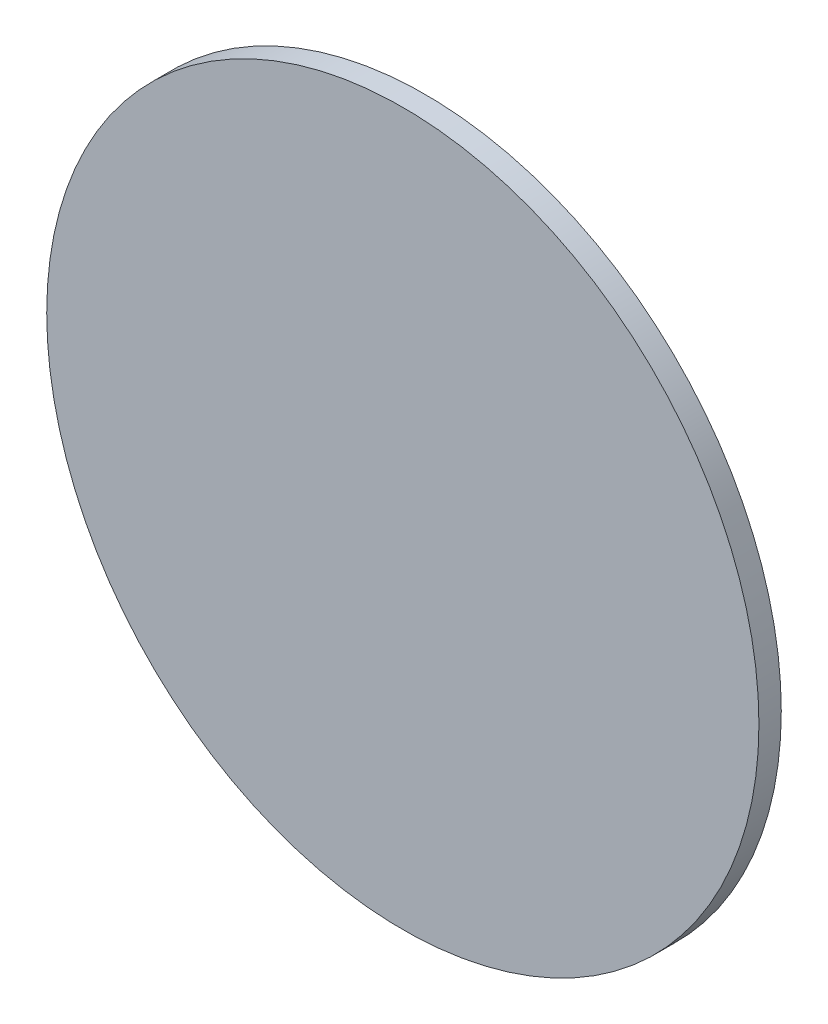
from build123d import *

# Parameters (mm, degrees)
ESQUISSE1_R      = 350.525
EXTRUSION1_DEPTH = 22


with BuildPart() as part:
    # Esquisse1 → Extrusion1 (new body)
    with BuildSketch(Plane.XY):
        Circle(ESQUISSE1_R)
    extrude(amount=EXTRUSION1_DEPTH)


solid = part.part
